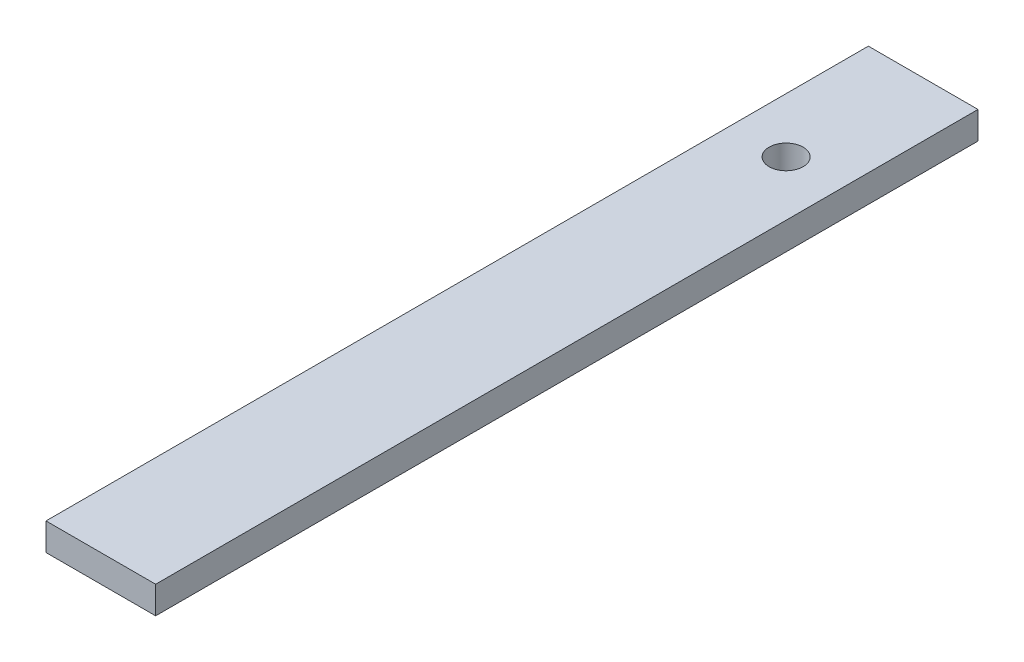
from build123d import *

# Parameters (mm, degrees)
SKETCH1_W           = 50.8
SKETCH1_H           = 381
SKETCH1_R           = 7.874
BOSS_EXTRUDE1_DEPTH = 12.7


with BuildPart() as part:
    # Sketch1 → Boss-Extrude1 (new body)
    with BuildSketch(Plane(origin=(0, 0, 0), x_dir=(1, 0, 0), z_dir=(0, 1, 0))):
        with Locations((25.4, 190.5)):
            Rectangle(SKETCH1_W, SKETCH1_H)
        with Locations(Location((25.4, 317.5, 0), (0, 0, 270))):
            Circle(SKETCH1_R, mode=Mode.SUBTRACT)
    extrude(amount=BOSS_EXTRUDE1_DEPTH)


solid = part.part
